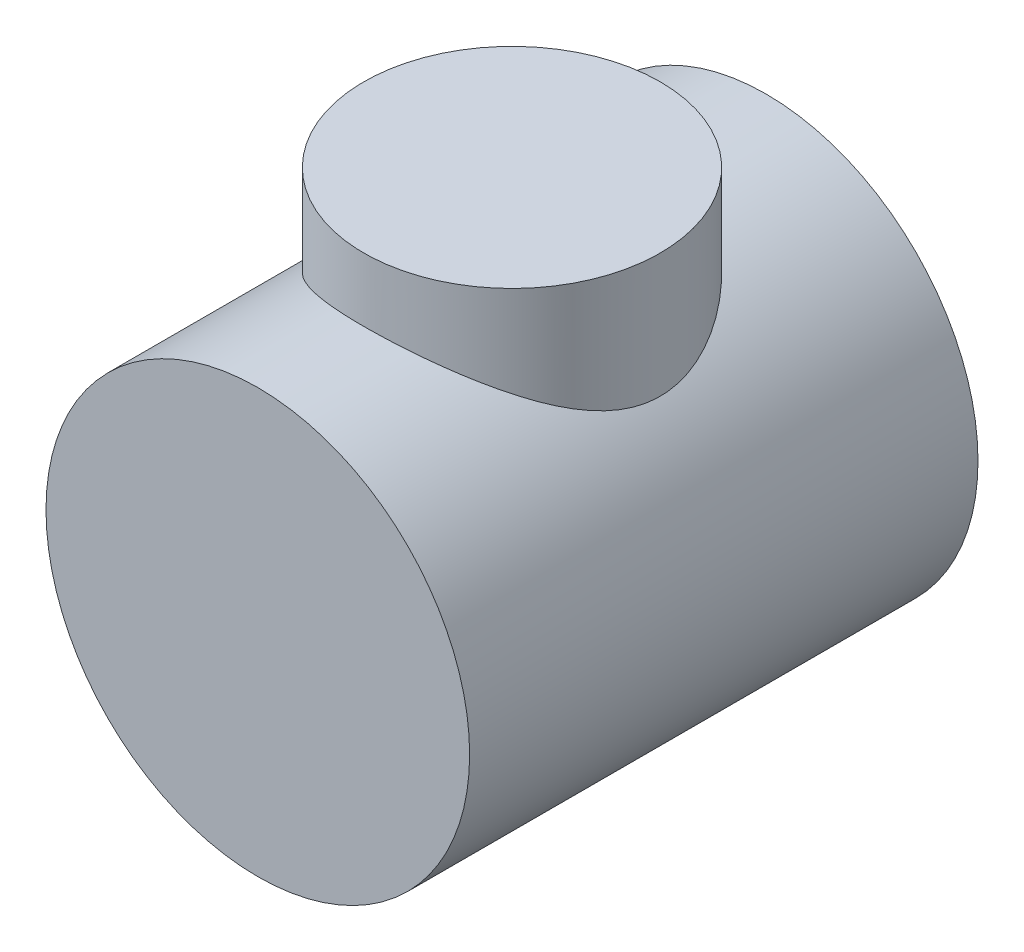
from build123d import *

# Parameters (mm, degrees)
SKETCH_1_R      = 50
EXTRUDE_1_DEPTH = 60


with BuildPart() as part:
    # Sketch 1 → Extrude 1 (new, symmetric)
    with BuildSketch(Plane.XY):
        with Locations(Location((0, 0, 0), (0, 0, 180))):
            Circle(SKETCH_1_R)
    extrude(amount=EXTRUDE_1_DEPTH, both=True)

    # Sketch 2 → Revolve 1 (revolve)
    with BuildSketch(Plane.XY, mode=Mode.PRIVATE) as revolve_1_sk:
        with BuildLine():
            Line((0, 65), (-35, 65))
            Line((-35, 65), (-35, 35.707142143))
            ThreePointArc((-35, 35.707142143), (-18.902948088, 46.289075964), (0, 50))
            Line((0, 50), (0, 65))
        make_face()
    revolve(revolve_1_sk.sketch.rotate(Axis((0, 0, 0), (0, 1, 0)), 270), axis=Axis((0, 0, 0), (0, 1, 0)))


solid = part.part
